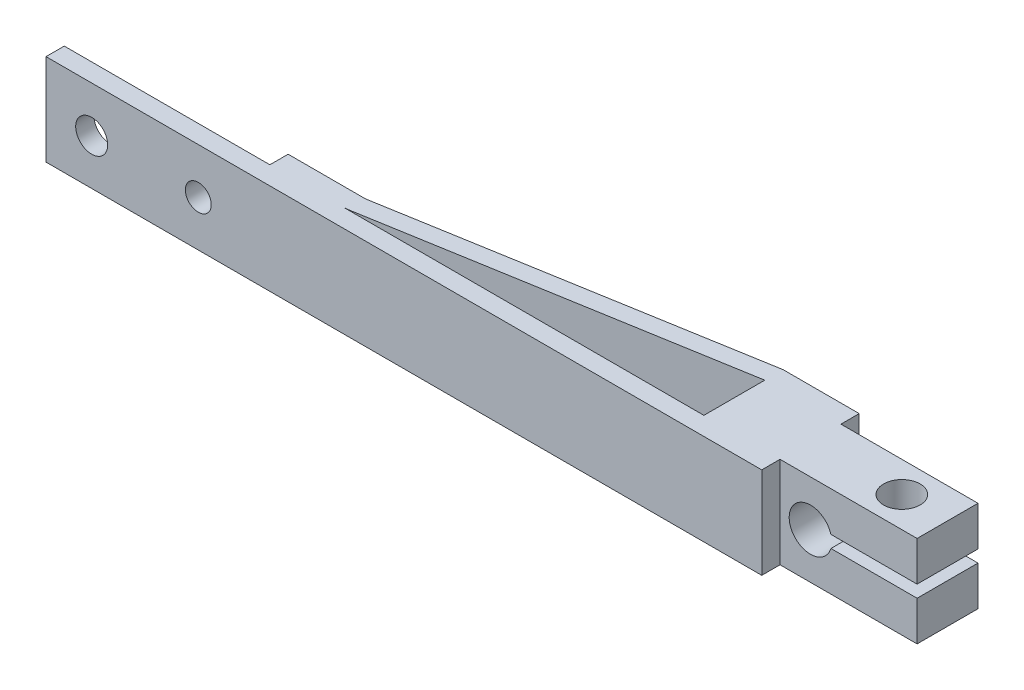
ISO-10303-21;
HEADER;
FILE_DESCRIPTION(('STEP AP214'),'2;1');
FILE_NAME('part.step','',(''),(''),'','','');
FILE_SCHEMA(('AUTOMOTIVE_DESIGN { 1 0 10303 214 1 1 1 1 }'));
ENDSEC;
DATA;
#1=APPLICATION_CONTEXT('core data for automotive mechanical design processes');
#2=APPLICATION_PROTOCOL_DEFINITION('international standard','automotive_design',2000,#1);
#3=PRODUCT_CONTEXT('',#1,'mechanical');
#4=PRODUCT('Part','Part','',(#3));
#5=PRODUCT_RELATED_PRODUCT_CATEGORY('part','',(#4));
#6=PRODUCT_DEFINITION_FORMATION('','',#4);
#7=PRODUCT_DEFINITION_CONTEXT('part definition',#1,'design');
#8=PRODUCT_DEFINITION('design','',#6,#7);
#9=PRODUCT_DEFINITION_SHAPE('','',#8);
#10=(LENGTH_UNIT() NAMED_UNIT(*) SI_UNIT(.MILLI.,.METRE.));
#11=(NAMED_UNIT(*) PLANE_ANGLE_UNIT() SI_UNIT($,.RADIAN.));
#12=(NAMED_UNIT(*) SI_UNIT($,.STERADIAN.) SOLID_ANGLE_UNIT());
#13=UNCERTAINTY_MEASURE_WITH_UNIT(LENGTH_MEASURE(1.E-05),#10,'distance_accuracy_value','');
#14=(GEOMETRIC_REPRESENTATION_CONTEXT(3) GLOBAL_UNCERTAINTY_ASSIGNED_CONTEXT((#13)) GLOBAL_UNIT_ASSIGNED_CONTEXT((#10,
#11,#12)) REPRESENTATION_CONTEXT('',''));
#15=CARTESIAN_POINT('',(0.,0.,0.));
#16=DIRECTION('',(0.,0.,1.));
#17=DIRECTION('',(1.,0.,0.));
#18=AXIS2_PLACEMENT_3D('',#15,#16,#17);
#19=CARTESIAN_POINT('',(25.,0.,20.));
#20=DIRECTION('',(0.,0.,-1.));
#21=DIRECTION('',(-1.,0.,0.));
#22=AXIS2_PLACEMENT_3D('',#19,#20,#21);
#23=PLANE('',#22);
#24=DIRECTION('',(1.,0.,0.));
#25=VECTOR('',#24,1.);
#26=CARTESIAN_POINT('',(25.,0.,20.));
#27=LINE('',#26,#25);
#28=CARTESIAN_POINT('',(-118.851979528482,0.,20.));
#29=VERTEX_POINT('',#28);
#30=CARTESIAN_POINT('',(0.,0.,20.));
#31=VERTEX_POINT('',#30);
#32=EDGE_CURVE('E36',#29,#31,#27,.T.);
#33=ORIENTED_EDGE('',*,*,#32,.F.);
#34=DIRECTION('',(0.,1.,0.));
#35=VECTOR('',#34,1.);
#36=CARTESIAN_POINT('',(-118.851979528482,0.,20.));
#37=LINE('',#36,#35);
#38=CARTESIAN_POINT('',(-118.851979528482,30.,20.));
#39=VERTEX_POINT('',#38);
#40=EDGE_CURVE('E407',#29,#39,#37,.T.);
#41=ORIENTED_EDGE('',*,*,#40,.T.);
#42=DIRECTION('',(-1.,0.,0.));
#43=VECTOR('',#42,1.);
#44=CARTESIAN_POINT('',(25.,30.,20.));
#45=LINE('',#44,#43);
#46=CARTESIAN_POINT('',(0.,30.,20.));
#47=VERTEX_POINT('',#46);
#48=EDGE_CURVE('E233',#47,#39,#45,.T.);
#49=ORIENTED_EDGE('',*,*,#48,.F.);
#50=DIRECTION('',(0.,-1.,0.));
#51=VECTOR('',#50,1.);
#52=CARTESIAN_POINT('',(0.,0.,20.));
#53=LINE('',#52,#51);
#54=EDGE_CURVE('E206',#47,#31,#53,.T.);
#55=ORIENTED_EDGE('',*,*,#54,.T.);
#56=EDGE_LOOP('',(#33,#41,#49,#55));
#57=FACE_BOUND('',#56,.T.);
#58=ADVANCED_FACE('F32',(#57),#23,.T.);
#59=CARTESIAN_POINT('',(0.,0.,20.));
#60=DIRECTION('',(1.,0.,0.));
#61=DIRECTION('',(0.,0.,-1.));
#62=AXIS2_PLACEMENT_3D('',#59,#60,#61);
#63=PLANE('',#62);
#64=DIRECTION('',(0.,-1.,0.));
#65=VECTOR('',#64,1.);
#66=CARTESIAN_POINT('',(0.,0.,0.));
#67=LINE('',#66,#65);
#68=CARTESIAN_POINT('',(0.,30.,0.));
#69=VERTEX_POINT('',#68);
#70=CARTESIAN_POINT('',(0.,0.,0.));
#71=VERTEX_POINT('',#70);
#72=EDGE_CURVE('E260',#69,#71,#67,.T.);
#73=ORIENTED_EDGE('',*,*,#72,.T.);
#74=DIRECTION('',(0.,0.,-1.));
#75=VECTOR('',#74,1.);
#76=CARTESIAN_POINT('',(0.,0.,20.));
#77=LINE('',#76,#75);
#78=EDGE_CURVE('E11',#31,#71,#77,.T.);
#79=ORIENTED_EDGE('',*,*,#78,.F.);
#80=ORIENTED_EDGE('',*,*,#54,.F.);
#81=DIRECTION('',(0.,0.,-1.));
#82=VECTOR('',#81,1.);
#83=CARTESIAN_POINT('',(0.,30.,20.));
#84=LINE('',#83,#82);
#85=EDGE_CURVE('E226',#47,#69,#84,.T.);
#86=ORIENTED_EDGE('',*,*,#85,.T.);
#87=EDGE_LOOP('',(#73,#79,#80,#86));
#88=FACE_BOUND('',#87,.T.);
#89=ADVANCED_FACE('F34',(#88),#63,.F.);
#90=CARTESIAN_POINT('',(0.,0.,20.));
#91=DIRECTION('',(0.,1.,0.));
#92=DIRECTION('',(0.,0.,1.));
#93=AXIS2_PLACEMENT_3D('',#90,#91,#92);
#94=PLANE('',#93);
#95=DIRECTION('',(0.,0.,-1.));
#96=VECTOR('',#95,1.);
#97=CARTESIAN_POINT('',(25.,0.,0.));
#98=LINE('',#97,#96);
#99=CARTESIAN_POINT('',(25.,0.,0.));
#100=VERTEX_POINT('',#99);
#101=CARTESIAN_POINT('',(25.,0.,-6.));
#102=VERTEX_POINT('',#101);
#103=EDGE_CURVE('E378',#100,#102,#98,.T.);
#104=ORIENTED_EDGE('',*,*,#103,.F.);
#105=DIRECTION('',(1.,0.,0.));
#106=VECTOR('',#105,1.);
#107=CARTESIAN_POINT('',(0.,0.,0.));
#108=LINE('',#107,#106);
#109=CARTESIAN_POINT('',(70.,0.,0.));
#110=VERTEX_POINT('',#109);
#111=EDGE_CURVE('E197',#100,#110,#108,.T.);
#112=ORIENTED_EDGE('',*,*,#111,.T.);
#113=DIRECTION('',(0.,0.,-1.));
#114=VECTOR('',#113,1.);
#115=CARTESIAN_POINT('',(70.,0.,20.));
#116=LINE('',#115,#114);
#117=CARTESIAN_POINT('',(70.,0.,20.));
#118=VERTEX_POINT('',#117);
#119=EDGE_CURVE('E42',#118,#110,#116,.T.);
#120=ORIENTED_EDGE('',*,*,#119,.F.);
#121=DIRECTION('',(1.,0.,0.));
#122=VECTOR('',#121,1.);
#123=CARTESIAN_POINT('',(0.,0.,20.));
#124=LINE('',#123,#122);
#125=CARTESIAN_POINT('',(25.,0.,20.));
#126=VERTEX_POINT('',#125);
#127=EDGE_CURVE('E210',#126,#118,#124,.T.);
#128=ORIENTED_EDGE('',*,*,#127,.F.);
#129=DIRECTION('',(0.,0.,-1.));
#130=VECTOR('',#129,1.);
#131=CARTESIAN_POINT('',(25.,0.,26.));
#132=LINE('',#131,#130);
#133=CARTESIAN_POINT('',(25.,0.,26.));
#134=VERTEX_POINT('',#133);
#135=EDGE_CURVE('E334',#134,#126,#132,.T.);
#136=ORIENTED_EDGE('',*,*,#135,.F.);
#137=DIRECTION('',(1.,0.,0.));
#138=VECTOR('',#137,1.);
#139=CARTESIAN_POINT('',(25.,0.,26.));
#140=LINE('',#139,#138);
#141=CARTESIAN_POINT('',(-210.,0.,26.));
#142=VERTEX_POINT('',#141);
#143=EDGE_CURVE('E341',#142,#134,#140,.T.);
#144=ORIENTED_EDGE('',*,*,#143,.F.);
#145=DIRECTION('',(0.,0.,-1.));
#146=VECTOR('',#145,1.);
#147=CARTESIAN_POINT('',(-210.,0.,26.));
#148=LINE('',#147,#146);
#149=CARTESIAN_POINT('',(-210.,0.,20.));
#150=VERTEX_POINT('',#149);
#151=EDGE_CURVE('E340',#142,#150,#148,.T.);
#152=ORIENTED_EDGE('',*,*,#151,.T.);
#153=CARTESIAN_POINT('',(-142.5,0.,20.));
#154=VERTEX_POINT('',#153);
#155=EDGE_CURVE('E245',#150,#154,#27,.T.);
#156=ORIENTED_EDGE('',*,*,#155,.T.);
#157=DIRECTION('',(0.,0.,1.));
#158=VECTOR('',#157,1.);
#159=CARTESIAN_POINT('',(-142.5,0.,20.));
#160=LINE('',#159,#158);
#161=CARTESIAN_POINT('',(-142.5,0.,14.));
#162=VERTEX_POINT('',#161);
#163=EDGE_CURVE('E398',#162,#154,#160,.T.);
#164=ORIENTED_EDGE('',*,*,#163,.F.);
#165=DIRECTION('',(-1.,0.,0.));
#166=VECTOR('',#165,1.);
#167=CARTESIAN_POINT('',(-117.924764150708,0.,14.));
#168=LINE('',#167,#166);
#169=CARTESIAN_POINT('',(-117.924764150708,0.,14.));
#170=VERTEX_POINT('',#169);
#171=EDGE_CURVE('E395',#170,#162,#168,.T.);
#172=ORIENTED_EDGE('',*,*,#171,.F.);
#173=CARTESIAN_POINT('',(-117.924764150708,0.,4.));
#174=DIRECTION('',(0.,-1.,0.));
#175=DIRECTION('',(-1.,0.,0.));
#176=AXIS2_PLACEMENT_3D('',#173,#174,#175);
#177=CIRCLE('',#176,10.);
#178=CARTESIAN_POINT('',(-116.240876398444,0.,13.8572066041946));
#179=VERTEX_POINT('',#178);
#180=EDGE_CURVE('E392',#179,#170,#177,.T.);
#181=ORIENTED_EDGE('',*,*,#180,.F.);
#182=DIRECTION('',(-0.985720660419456,0.,0.168388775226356));
#183=VECTOR('',#182,1.);
#184=CARTESIAN_POINT('',(0.,0.,-6.));
#185=LINE('',#184,#183);
#186=CARTESIAN_POINT('',(0.,0.,-6.));
#187=VERTEX_POINT('',#186);
#188=EDGE_CURVE('E384',#187,#179,#185,.T.);
#189=ORIENTED_EDGE('',*,*,#188,.F.);
#190=DIRECTION('',(-1.,0.,0.));
#191=VECTOR('',#190,1.);
#192=CARTESIAN_POINT('',(0.,0.,-6.));
#193=LINE('',#192,#191);
#194=EDGE_CURVE('E381',#102,#187,#193,.T.);
#195=ORIENTED_EDGE('',*,*,#194,.F.);
#196=EDGE_LOOP('',(#104,#112,#120,#128,#136,#144,#152,#156,#164,#172,#181,#189,#195));
#197=FACE_BOUND('',#196,.T.);
#198=CARTESIAN_POINT('',(55.,0.,10.));
#199=DIRECTION('',(0.,1.,0.));
#200=DIRECTION('',(-1.,0.,0.));
#201=AXIS2_PLACEMENT_3D('',#198,#199,#200);
#202=CIRCLE('',#201,5.99999999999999);
#203=CARTESIAN_POINT('',(49.,0.,10.));
#204=VERTEX_POINT('',#203);
#205=EDGE_CURVE('E250',#204,#204,#202,.T.);
#206=ORIENTED_EDGE('',*,*,#205,.T.);
#207=EDGE_LOOP('',(#206));
#208=FACE_BOUND('',#207,.T.);
#209=ORIENTED_EDGE('',*,*,#78,.T.);
#210=DIRECTION('',(0.985821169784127,0.,-0.167799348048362));
#211=VECTOR('',#210,1.);
#212=CARTESIAN_POINT('',(0.,0.,0.));
#213=LINE('',#212,#211);
#214=CARTESIAN_POINT('',(-116.167189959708,0.,19.773138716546));
#215=VERTEX_POINT('',#214);
#216=EDGE_CURVE('E198',#215,#71,#213,.T.);
#217=ORIENTED_EDGE('',*,*,#216,.F.);
#218=CARTESIAN_POINT('',(-118.851979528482,0.,4.));
#219=DIRECTION('',(0.,1.,0.));
#220=DIRECTION('',(-1.,0.,0.));
#221=AXIS2_PLACEMENT_3D('',#218,#219,#220);
#222=CIRCLE('',#221,16.);
#223=EDGE_CURVE('E400',#29,#215,#222,.T.);
#224=ORIENTED_EDGE('',*,*,#223,.F.);
#225=ORIENTED_EDGE('',*,*,#32,.T.);
#226=EDGE_LOOP('',(#209,#217,#224,#225));
#227=FACE_BOUND('',#226,.T.);
#228=ADVANCED_FACE('F375',(#197,#208,#227),#94,.F.);
#229=CARTESIAN_POINT('',(70.,0.,20.));
#230=DIRECTION('',(-1.,0.,0.));
#231=DIRECTION('',(0.,0.,1.));
#232=AXIS2_PLACEMENT_3D('',#229,#230,#231);
#233=PLANE('',#232);
#234=DIRECTION('',(0.,1.,0.));
#235=VECTOR('',#234,1.);
#236=CARTESIAN_POINT('',(70.,0.,0.));
#237=LINE('',#236,#235);
#238=CARTESIAN_POINT('',(70.,13.,0.));
#239=VERTEX_POINT('',#238);
#240=EDGE_CURVE('E264',#110,#239,#237,.T.);
#241=ORIENTED_EDGE('',*,*,#240,.T.);
#242=DIRECTION('',(0.,0.,-1.));
#243=VECTOR('',#242,1.);
#244=CARTESIAN_POINT('',(70.,13.,20.));
#245=LINE('',#244,#243);
#246=CARTESIAN_POINT('',(70.,13.,20.));
#247=VERTEX_POINT('',#246);
#248=EDGE_CURVE('E292',#247,#239,#245,.T.);
#249=ORIENTED_EDGE('',*,*,#248,.F.);
#250=DIRECTION('',(0.,1.,0.));
#251=VECTOR('',#250,1.);
#252=CARTESIAN_POINT('',(70.,0.,20.));
#253=LINE('',#252,#251);
#254=EDGE_CURVE('E298',#118,#247,#253,.T.);
#255=ORIENTED_EDGE('',*,*,#254,.F.);
#256=ORIENTED_EDGE('',*,*,#119,.T.);
#257=EDGE_LOOP('',(#241,#249,#255,#256));
#258=FACE_BOUND('',#257,.T.);
#259=ADVANCED_FACE('F316',(#258),#233,.F.);
#260=CARTESIAN_POINT('',(70.,13.,20.));
#261=DIRECTION('',(0.,-1.,0.));
#262=DIRECTION('',(1.,0.,0.));
#263=AXIS2_PLACEMENT_3D('',#260,#261,#262);
#264=PLANE('',#263);
#265=CARTESIAN_POINT('',(55.,13.,10.));
#266=DIRECTION('',(0.,-1.,0.));
#267=DIRECTION('',(1.,0.,0.));
#268=AXIS2_PLACEMENT_3D('',#265,#266,#267);
#269=CIRCLE('',#268,5.99999999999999);
#270=CARTESIAN_POINT('',(61.,13.,10.));
#271=VERTEX_POINT('',#270);
#272=EDGE_CURVE('E257',#271,#271,#269,.T.);
#273=ORIENTED_EDGE('',*,*,#272,.T.);
#274=EDGE_LOOP('',(#273));
#275=FACE_BOUND('',#274,.T.);
#276=DIRECTION('',(-1.,0.,0.));
#277=VECTOR('',#276,1.);
#278=CARTESIAN_POINT('',(70.,13.,0.));
#279=LINE('',#278,#277);
#280=CARTESIAN_POINT('',(41.7082039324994,13.,0.));
#281=VERTEX_POINT('',#280);
#282=EDGE_CURVE('E266',#239,#281,#279,.T.);
#283=ORIENTED_EDGE('',*,*,#282,.T.);
#284=DIRECTION('',(0.,0.,-1.));
#285=VECTOR('',#284,1.);
#286=CARTESIAN_POINT('',(41.7082039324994,13.,20.));
#287=LINE('',#286,#285);
#288=CARTESIAN_POINT('',(41.7082039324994,13.,20.));
#289=VERTEX_POINT('',#288);
#290=EDGE_CURVE('E285',#289,#281,#287,.T.);
#291=ORIENTED_EDGE('',*,*,#290,.F.);
#292=DIRECTION('',(-1.,0.,0.));
#293=VECTOR('',#292,1.);
#294=CARTESIAN_POINT('',(70.,13.,20.));
#295=LINE('',#294,#293);
#296=EDGE_CURVE('E308',#247,#289,#295,.T.);
#297=ORIENTED_EDGE('',*,*,#296,.F.);
#298=ORIENTED_EDGE('',*,*,#248,.T.);
#299=EDGE_LOOP('',(#283,#291,#297,#298));
#300=FACE_BOUND('',#299,.T.);
#301=ADVANCED_FACE('F319',(#275,#300),#264,.F.);
#302=CARTESIAN_POINT('',(35.,15.,20.));
#303=DIRECTION('',(0.,0.,-1.));
#304=DIRECTION('',(-1.,0.,0.));
#305=AXIS2_PLACEMENT_3D('',#302,#303,#304);
#306=CYLINDRICAL_SURFACE('',#305,7.);
#307=CARTESIAN_POINT('',(35.,15.,0.));
#308=DIRECTION('',(0.,0.,-1.));
#309=DIRECTION('',(1.,0.,0.));
#310=AXIS2_PLACEMENT_3D('',#307,#308,#309);
#311=CIRCLE('',#310,7.);
#312=CARTESIAN_POINT('',(41.7082039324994,17.,0.));
#313=VERTEX_POINT('',#312);
#314=EDGE_CURVE('E268',#281,#313,#311,.T.);
#315=ORIENTED_EDGE('',*,*,#314,.T.);
#316=DIRECTION('',(0.,0.,-1.));
#317=VECTOR('',#316,1.);
#318=CARTESIAN_POINT('',(41.7082039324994,17.,20.));
#319=LINE('',#318,#317);
#320=CARTESIAN_POINT('',(41.7082039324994,17.,20.));
#321=VERTEX_POINT('',#320);
#322=EDGE_CURVE('E279',#321,#313,#319,.T.);
#323=ORIENTED_EDGE('',*,*,#322,.F.);
#324=CARTESIAN_POINT('',(35.,15.,20.));
#325=DIRECTION('',(0.,0.,-1.));
#326=DIRECTION('',(1.,0.,0.));
#327=AXIS2_PLACEMENT_3D('',#324,#325,#326);
#328=CIRCLE('',#327,7.);
#329=EDGE_CURVE('E306',#289,#321,#328,.T.);
#330=ORIENTED_EDGE('',*,*,#329,.F.);
#331=ORIENTED_EDGE('',*,*,#290,.T.);
#332=EDGE_LOOP('',(#315,#323,#330,#331));
#333=FACE_BOUND('',#332,.T.);
#334=ADVANCED_FACE('F322',(#333),#306,.F.);
#335=CARTESIAN_POINT('',(70.,17.,20.));
#336=DIRECTION('',(0.,1.,0.));
#337=DIRECTION('',(-1.,0.,0.));
#338=AXIS2_PLACEMENT_3D('',#335,#336,#337);
#339=PLANE('',#338);
#340=CARTESIAN_POINT('',(55.,17.,10.));
#341=DIRECTION('',(0.,1.,0.));
#342=DIRECTION('',(-1.,0.,0.));
#343=AXIS2_PLACEMENT_3D('',#340,#341,#342);
#344=CIRCLE('',#343,5.99999999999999);
#345=CARTESIAN_POINT('',(49.,17.,10.));
#346=VERTEX_POINT('',#345);
#347=EDGE_CURVE('E254',#346,#346,#344,.T.);
#348=ORIENTED_EDGE('',*,*,#347,.T.);
#349=EDGE_LOOP('',(#348));
#350=FACE_BOUND('',#349,.T.);
#351=DIRECTION('',(1.,0.,0.));
#352=VECTOR('',#351,1.);
#353=CARTESIAN_POINT('',(70.,17.,0.));
#354=LINE('',#353,#352);
#355=CARTESIAN_POINT('',(70.,17.,0.));
#356=VERTEX_POINT('',#355);
#357=EDGE_CURVE('E212',#313,#356,#354,.T.);
#358=ORIENTED_EDGE('',*,*,#357,.T.);
#359=DIRECTION('',(0.,0.,-1.));
#360=VECTOR('',#359,1.);
#361=CARTESIAN_POINT('',(70.,17.,20.));
#362=LINE('',#361,#360);
#363=CARTESIAN_POINT('',(70.,17.,20.));
#364=VERTEX_POINT('',#363);
#365=EDGE_CURVE('E276',#364,#356,#362,.T.);
#366=ORIENTED_EDGE('',*,*,#365,.F.);
#367=DIRECTION('',(1.,0.,0.));
#368=VECTOR('',#367,1.);
#369=CARTESIAN_POINT('',(70.,17.,20.));
#370=LINE('',#369,#368);
#371=EDGE_CURVE('E304',#321,#364,#370,.T.);
#372=ORIENTED_EDGE('',*,*,#371,.F.);
#373=ORIENTED_EDGE('',*,*,#322,.T.);
#374=EDGE_LOOP('',(#358,#366,#372,#373));
#375=FACE_BOUND('',#374,.T.);
#376=ADVANCED_FACE('F274',(#350,#375),#339,.F.);
#377=CARTESIAN_POINT('',(70.,17.,20.));
#378=DIRECTION('',(-1.,0.,0.));
#379=DIRECTION('',(0.,0.,1.));
#380=AXIS2_PLACEMENT_3D('',#377,#378,#379);
#381=PLANE('',#380);
#382=DIRECTION('',(0.,1.,0.));
#383=VECTOR('',#382,1.);
#384=CARTESIAN_POINT('',(70.,17.,0.));
#385=LINE('',#384,#383);
#386=CARTESIAN_POINT('',(70.,30.,0.));
#387=VERTEX_POINT('',#386);
#388=EDGE_CURVE('E207',#356,#387,#385,.T.);
#389=ORIENTED_EDGE('',*,*,#388,.T.);
#390=DIRECTION('',(0.,0.,-1.));
#391=VECTOR('',#390,1.);
#392=CARTESIAN_POINT('',(70.,30.,20.));
#393=LINE('',#392,#391);
#394=CARTESIAN_POINT('',(70.,30.,20.));
#395=VERTEX_POINT('',#394);
#396=EDGE_CURVE('E205',#395,#387,#393,.T.);
#397=ORIENTED_EDGE('',*,*,#396,.F.);
#398=DIRECTION('',(0.,1.,0.));
#399=VECTOR('',#398,1.);
#400=CARTESIAN_POINT('',(70.,17.,20.));
#401=LINE('',#400,#399);
#402=EDGE_CURVE('E283',#364,#395,#401,.T.);
#403=ORIENTED_EDGE('',*,*,#402,.F.);
#404=ORIENTED_EDGE('',*,*,#365,.T.);
#405=EDGE_LOOP('',(#389,#397,#403,#404));
#406=FACE_BOUND('',#405,.T.);
#407=ADVANCED_FACE('F282',(#406),#381,.F.);
#408=CARTESIAN_POINT('',(0.,30.,20.));
#409=DIRECTION('',(0.,-1.,0.));
#410=DIRECTION('',(1.,0.,0.));
#411=AXIS2_PLACEMENT_3D('',#408,#409,#410);
#412=PLANE('',#411);
#413=DIRECTION('',(-1.,0.,0.));
#414=VECTOR('',#413,1.);
#415=CARTESIAN_POINT('',(0.,30.,0.));
#416=LINE('',#415,#414);
#417=CARTESIAN_POINT('',(25.,30.,0.));
#418=VERTEX_POINT('',#417);
#419=EDGE_CURVE('E195',#387,#418,#416,.T.);
#420=ORIENTED_EDGE('',*,*,#419,.T.);
#421=DIRECTION('',(0.,0.,-1.));
#422=VECTOR('',#421,1.);
#423=CARTESIAN_POINT('',(25.,30.,0.));
#424=LINE('',#423,#422);
#425=CARTESIAN_POINT('',(25.,30.,-6.));
#426=VERTEX_POINT('',#425);
#427=EDGE_CURVE('E178',#418,#426,#424,.T.);
#428=ORIENTED_EDGE('',*,*,#427,.T.);
#429=DIRECTION('',(-1.,0.,0.));
#430=VECTOR('',#429,1.);
#431=CARTESIAN_POINT('',(0.,30.,-6.));
#432=LINE('',#431,#430);
#433=CARTESIAN_POINT('',(0.,30.,-6.));
#434=VERTEX_POINT('',#433);
#435=EDGE_CURVE('E188',#426,#434,#432,.T.);
#436=ORIENTED_EDGE('',*,*,#435,.T.);
#437=DIRECTION('',(-0.985720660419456,0.,0.168388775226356));
#438=VECTOR('',#437,1.);
#439=CARTESIAN_POINT('',(0.,30.,-6.));
#440=LINE('',#439,#438);
#441=CARTESIAN_POINT('',(-116.240876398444,30.,13.8572066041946));
#442=VERTEX_POINT('',#441);
#443=EDGE_CURVE('E668',#434,#442,#440,.T.);
#444=ORIENTED_EDGE('',*,*,#443,.T.);
#445=CARTESIAN_POINT('',(-117.924764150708,30.,4.));
#446=DIRECTION('',(0.,-1.,0.));
#447=DIRECTION('',(-1.,0.,0.));
#448=AXIS2_PLACEMENT_3D('',#445,#446,#447);
#449=CIRCLE('',#448,10.);
#450=CARTESIAN_POINT('',(-117.924764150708,30.,14.));
#451=VERTEX_POINT('',#450);
#452=EDGE_CURVE('E670',#442,#451,#449,.T.);
#453=ORIENTED_EDGE('',*,*,#452,.T.);
#454=DIRECTION('',(-1.,0.,0.));
#455=VECTOR('',#454,1.);
#456=CARTESIAN_POINT('',(-117.924764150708,30.,14.));
#457=LINE('',#456,#455);
#458=CARTESIAN_POINT('',(-142.5,30.,14.));
#459=VERTEX_POINT('',#458);
#460=EDGE_CURVE('E675',#451,#459,#457,.T.);
#461=ORIENTED_EDGE('',*,*,#460,.T.);
#462=DIRECTION('',(0.,0.,1.));
#463=VECTOR('',#462,1.);
#464=CARTESIAN_POINT('',(-142.5,30.,20.));
#465=LINE('',#464,#463);
#466=CARTESIAN_POINT('',(-142.5,30.,20.));
#467=VERTEX_POINT('',#466);
#468=EDGE_CURVE('E50',#459,#467,#465,.T.);
#469=ORIENTED_EDGE('',*,*,#468,.T.);
#470=CARTESIAN_POINT('',(-210.,30.,20.));
#471=VERTEX_POINT('',#470);
#472=EDGE_CURVE('E231',#467,#471,#45,.T.);
#473=ORIENTED_EDGE('',*,*,#472,.T.);
#474=DIRECTION('',(0.,0.,-1.));
#475=VECTOR('',#474,1.);
#476=CARTESIAN_POINT('',(-210.,30.,26.));
#477=LINE('',#476,#475);
#478=CARTESIAN_POINT('',(-210.,30.,26.));
#479=VERTEX_POINT('',#478);
#480=EDGE_CURVE('E330',#479,#471,#477,.T.);
#481=ORIENTED_EDGE('',*,*,#480,.F.);
#482=DIRECTION('',(-1.,0.,0.));
#483=VECTOR('',#482,1.);
#484=CARTESIAN_POINT('',(25.,30.,26.));
#485=LINE('',#484,#483);
#486=CARTESIAN_POINT('',(25.,30.,26.));
#487=VERTEX_POINT('',#486);
#488=EDGE_CURVE('E326',#487,#479,#485,.T.);
#489=ORIENTED_EDGE('',*,*,#488,.F.);
#490=DIRECTION('',(0.,0.,-1.));
#491=VECTOR('',#490,1.);
#492=CARTESIAN_POINT('',(25.,30.,26.));
#493=LINE('',#492,#491);
#494=CARTESIAN_POINT('',(25.,30.,20.));
#495=VERTEX_POINT('',#494);
#496=EDGE_CURVE('E251',#487,#495,#493,.T.);
#497=ORIENTED_EDGE('',*,*,#496,.T.);
#498=DIRECTION('',(-1.,0.,0.));
#499=VECTOR('',#498,1.);
#500=CARTESIAN_POINT('',(0.,30.,20.));
#501=LINE('',#500,#499);
#502=EDGE_CURVE('E229',#395,#495,#501,.T.);
#503=ORIENTED_EDGE('',*,*,#502,.F.);
#504=ORIENTED_EDGE('',*,*,#396,.T.);
#505=EDGE_LOOP('',(#420,#428,#436,#444,#453,#461,#469,#473,#481,#489,#497,#503,#504));
#506=FACE_BOUND('',#505,.T.);
#507=CARTESIAN_POINT('',(55.,30.,10.));
#508=DIRECTION('',(0.,1.,0.));
#509=DIRECTION('',(-1.,0.,0.));
#510=AXIS2_PLACEMENT_3D('',#507,#508,#509);
#511=CIRCLE('',#510,5.99999999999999);
#512=CARTESIAN_POINT('',(49.,30.,10.));
#513=VERTEX_POINT('',#512);
#514=EDGE_CURVE('E247',#513,#513,#511,.T.);
#515=ORIENTED_EDGE('',*,*,#514,.F.);
#516=EDGE_LOOP('',(#515));
#517=FACE_BOUND('',#516,.T.);
#518=DIRECTION('',(0.985821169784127,0.,-0.167799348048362));
#519=VECTOR('',#518,1.);
#520=CARTESIAN_POINT('',(0.,30.,0.));
#521=LINE('',#520,#519);
#522=CARTESIAN_POINT('',(-116.167189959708,30.,19.773138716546));
#523=VERTEX_POINT('',#522);
#524=EDGE_CURVE('E382',#523,#69,#521,.T.);
#525=ORIENTED_EDGE('',*,*,#524,.T.);
#526=ORIENTED_EDGE('',*,*,#85,.F.);
#527=ORIENTED_EDGE('',*,*,#48,.T.);
#528=CARTESIAN_POINT('',(-118.851979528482,30.,4.));
#529=DIRECTION('',(0.,1.,0.));
#530=DIRECTION('',(-1.,0.,0.));
#531=AXIS2_PLACEMENT_3D('',#528,#529,#530);
#532=CIRCLE('',#531,16.);
#533=EDGE_CURVE('E386',#39,#523,#532,.T.);
#534=ORIENTED_EDGE('',*,*,#533,.T.);
#535=EDGE_LOOP('',(#525,#526,#527,#534));
#536=FACE_BOUND('',#535,.T.);
#537=ADVANCED_FACE('F201',(#506,#517,#536),#412,.F.);
#538=CARTESIAN_POINT('',(35.,15.,20.));
#539=DIRECTION('',(0.,0.,1.));
#540=DIRECTION('',(1.,0.,0.));
#541=AXIS2_PLACEMENT_3D('',#538,#539,#540);
#542=PLANE('',#541);
#543=DIRECTION('',(0.,1.,0.));
#544=VECTOR('',#543,1.);
#545=CARTESIAN_POINT('',(25.,30.,20.));
#546=LINE('',#545,#544);
#547=EDGE_CURVE('E58',#126,#495,#546,.T.);
#548=ORIENTED_EDGE('',*,*,#547,.F.);
#549=ORIENTED_EDGE('',*,*,#127,.T.);
#550=ORIENTED_EDGE('',*,*,#254,.T.);
#551=ORIENTED_EDGE('',*,*,#296,.T.);
#552=ORIENTED_EDGE('',*,*,#329,.T.);
#553=ORIENTED_EDGE('',*,*,#371,.T.);
#554=ORIENTED_EDGE('',*,*,#402,.T.);
#555=ORIENTED_EDGE('',*,*,#502,.T.);
#556=EDGE_LOOP('',(#548,#549,#550,#551,#552,#553,#554,#555));
#557=FACE_BOUND('',#556,.T.);
#558=ADVANCED_FACE('F311',(#557),#542,.T.);
#559=CARTESIAN_POINT('',(35.,15.,0.));
#560=DIRECTION('',(0.,0.,1.));
#561=DIRECTION('',(1.,0.,0.));
#562=AXIS2_PLACEMENT_3D('',#559,#560,#561);
#563=PLANE('',#562);
#564=ORIENTED_EDGE('',*,*,#111,.F.);
#565=DIRECTION('',(0.,1.,0.));
#566=VECTOR('',#565,1.);
#567=CARTESIAN_POINT('',(25.,0.,0.));
#568=LINE('',#567,#566);
#569=EDGE_CURVE('E182',#100,#418,#568,.T.);
#570=ORIENTED_EDGE('',*,*,#569,.T.);
#571=ORIENTED_EDGE('',*,*,#419,.F.);
#572=ORIENTED_EDGE('',*,*,#388,.F.);
#573=ORIENTED_EDGE('',*,*,#357,.F.);
#574=ORIENTED_EDGE('',*,*,#314,.F.);
#575=ORIENTED_EDGE('',*,*,#282,.F.);
#576=ORIENTED_EDGE('',*,*,#240,.F.);
#577=EDGE_LOOP('',(#564,#570,#571,#572,#573,#574,#575,#576));
#578=FACE_BOUND('',#577,.T.);
#579=ADVANCED_FACE('F193',(#578),#563,.F.);
#580=CARTESIAN_POINT('',(55.,0.,10.));
#581=DIRECTION('',(0.,1.,0.));
#582=DIRECTION('',(-1.,0.,0.));
#583=AXIS2_PLACEMENT_3D('',#580,#581,#582);
#584=CYLINDRICAL_SURFACE('',#583,5.99999999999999);
#585=ORIENTED_EDGE('',*,*,#514,.T.);
#586=EDGE_LOOP('',(#585));
#587=FACE_BOUND('',#586,.T.);
#588=ORIENTED_EDGE('',*,*,#347,.F.);
#589=EDGE_LOOP('',(#588));
#590=FACE_BOUND('',#589,.T.);
#591=ADVANCED_FACE('F462',(#587,#590),#584,.F.);
#592=ORIENTED_EDGE('',*,*,#205,.F.);
#593=EDGE_LOOP('',(#592));
#594=FACE_BOUND('',#593,.T.);
#595=ORIENTED_EDGE('',*,*,#272,.F.);
#596=EDGE_LOOP('',(#595));
#597=FACE_BOUND('',#596,.T.);
#598=ADVANCED_FACE('F457',(#594,#597),#584,.F.);
#599=CARTESIAN_POINT('',(25.,0.,26.));
#600=DIRECTION('',(0.,0.,-1.));
#601=DIRECTION('',(-1.,0.,0.));
#602=AXIS2_PLACEMENT_3D('',#599,#600,#601);
#603=PLANE('',#602);
#604=CARTESIAN_POINT('',(-195.,15.,26.));
#605=DIRECTION('',(0.,0.,1.));
#606=DIRECTION('',(1.,0.,0.));
#607=AXIS2_PLACEMENT_3D('',#604,#605,#606);
#608=CIRCLE('',#607,5.25);
#609=CARTESIAN_POINT('',(-189.75,15.,26.));
#610=VERTEX_POINT('',#609);
#611=EDGE_CURVE('E335',#610,#610,#608,.T.);
#612=ORIENTED_EDGE('',*,*,#611,.F.);
#613=EDGE_LOOP('',(#612));
#614=FACE_BOUND('',#613,.T.);
#615=DIRECTION('',(0.,1.,0.));
#616=VECTOR('',#615,1.);
#617=CARTESIAN_POINT('',(25.,30.,26.));
#618=LINE('',#617,#616);
#619=EDGE_CURVE('E367',#134,#487,#618,.T.);
#620=ORIENTED_EDGE('',*,*,#619,.T.);
#621=ORIENTED_EDGE('',*,*,#488,.T.);
#622=DIRECTION('',(0.,-1.,0.));
#623=VECTOR('',#622,1.);
#624=CARTESIAN_POINT('',(-210.,30.,26.));
#625=LINE('',#624,#623);
#626=EDGE_CURVE('E344',#479,#142,#625,.T.);
#627=ORIENTED_EDGE('',*,*,#626,.T.);
#628=ORIENTED_EDGE('',*,*,#143,.T.);
#629=EDGE_LOOP('',(#620,#621,#627,#628));
#630=FACE_BOUND('',#629,.T.);
#631=CARTESIAN_POINT('',(-160.,15.,26.));
#632=DIRECTION('',(0.,0.,1.));
#633=DIRECTION('',(1.,0.,0.));
#634=AXIS2_PLACEMENT_3D('',#631,#632,#633);
#635=CIRCLE('',#634,4.24999999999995);
#636=CARTESIAN_POINT('',(-155.75,15.,26.));
#637=VERTEX_POINT('',#636);
#638=EDGE_CURVE('E423',#637,#637,#635,.T.);
#639=ORIENTED_EDGE('',*,*,#638,.F.);
#640=EDGE_LOOP('',(#639));
#641=FACE_BOUND('',#640,.T.);
#642=ADVANCED_FACE('F373',(#614,#630,#641),#603,.F.);
#643=DIRECTION('',(0.,1.,0.));
#644=VECTOR('',#643,1.);
#645=CARTESIAN_POINT('',(-142.5,0.,20.));
#646=LINE('',#645,#644);
#647=EDGE_CURVE('E410',#154,#467,#646,.T.);
#648=ORIENTED_EDGE('',*,*,#647,.F.);
#649=ORIENTED_EDGE('',*,*,#155,.F.);
#650=DIRECTION('',(0.,-1.,0.));
#651=VECTOR('',#650,1.);
#652=CARTESIAN_POINT('',(-210.,30.,20.));
#653=LINE('',#652,#651);
#654=EDGE_CURVE('E239',#471,#150,#653,.T.);
#655=ORIENTED_EDGE('',*,*,#654,.F.);
#656=ORIENTED_EDGE('',*,*,#472,.F.);
#657=EDGE_LOOP('',(#648,#649,#655,#656));
#658=FACE_BOUND('',#657,.T.);
#659=CARTESIAN_POINT('',(-195.,15.,20.));
#660=DIRECTION('',(0.,0.,1.));
#661=DIRECTION('',(1.,0.,0.));
#662=AXIS2_PLACEMENT_3D('',#659,#660,#661);
#663=CIRCLE('',#662,5.25);
#664=CARTESIAN_POINT('',(-189.75,15.,20.));
#665=VERTEX_POINT('',#664);
#666=EDGE_CURVE('E338',#665,#665,#663,.T.);
#667=ORIENTED_EDGE('',*,*,#666,.T.);
#668=EDGE_LOOP('',(#667));
#669=FACE_BOUND('',#668,.T.);
#670=CARTESIAN_POINT('',(-160.,15.,20.));
#671=DIRECTION('',(0.,0.,1.));
#672=DIRECTION('',(1.,0.,0.));
#673=AXIS2_PLACEMENT_3D('',#670,#671,#672);
#674=CIRCLE('',#673,4.24999999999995);
#675=CARTESIAN_POINT('',(-155.75,15.,20.));
#676=VERTEX_POINT('',#675);
#677=EDGE_CURVE('E406',#676,#676,#674,.T.);
#678=ORIENTED_EDGE('',*,*,#677,.T.);
#679=EDGE_LOOP('',(#678));
#680=FACE_BOUND('',#679,.T.);
#681=ADVANCED_FACE('F360',(#658,#669,#680),#23,.T.);
#682=CARTESIAN_POINT('',(25.,30.,26.));
#683=DIRECTION('',(-1.,0.,0.));
#684=DIRECTION('',(0.,-1.,0.));
#685=AXIS2_PLACEMENT_3D('',#682,#683,#684);
#686=PLANE('',#685);
#687=ORIENTED_EDGE('',*,*,#547,.T.);
#688=ORIENTED_EDGE('',*,*,#496,.F.);
#689=ORIENTED_EDGE('',*,*,#619,.F.);
#690=ORIENTED_EDGE('',*,*,#135,.T.);
#691=EDGE_LOOP('',(#687,#688,#689,#690));
#692=FACE_BOUND('',#691,.T.);
#693=ADVANCED_FACE('F332',(#692),#686,.F.);
#694=CARTESIAN_POINT('',(-210.,30.,26.));
#695=DIRECTION('',(1.,0.,0.));
#696=DIRECTION('',(0.,0.,-1.));
#697=AXIS2_PLACEMENT_3D('',#694,#695,#696);
#698=PLANE('',#697);
#699=ORIENTED_EDGE('',*,*,#654,.T.);
#700=ORIENTED_EDGE('',*,*,#151,.F.);
#701=ORIENTED_EDGE('',*,*,#626,.F.);
#702=ORIENTED_EDGE('',*,*,#480,.T.);
#703=EDGE_LOOP('',(#699,#700,#701,#702));
#704=FACE_BOUND('',#703,.T.);
#705=ADVANCED_FACE('F354',(#704),#698,.F.);
#706=CARTESIAN_POINT('',(-195.,15.,26.));
#707=DIRECTION('',(0.,0.,-1.));
#708=DIRECTION('',(-1.,0.,0.));
#709=AXIS2_PLACEMENT_3D('',#706,#707,#708);
#710=CYLINDRICAL_SURFACE('',#709,5.25);
#711=ORIENTED_EDGE('',*,*,#611,.T.);
#712=EDGE_LOOP('',(#711));
#713=FACE_BOUND('',#712,.T.);
#714=ORIENTED_EDGE('',*,*,#666,.F.);
#715=EDGE_LOOP('',(#714));
#716=FACE_BOUND('',#715,.T.);
#717=ADVANCED_FACE('F430',(#713,#716),#710,.F.);
#718=CARTESIAN_POINT('',(-160.,15.,26.));
#719=DIRECTION('',(0.,0.,-1.));
#720=DIRECTION('',(-1.,0.,0.));
#721=AXIS2_PLACEMENT_3D('',#718,#719,#720);
#722=CYLINDRICAL_SURFACE('',#721,4.24999999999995);
#723=ORIENTED_EDGE('',*,*,#638,.T.);
#724=EDGE_LOOP('',(#723));
#725=FACE_BOUND('',#724,.T.);
#726=ORIENTED_EDGE('',*,*,#677,.F.);
#727=EDGE_LOOP('',(#726));
#728=FACE_BOUND('',#727,.T.);
#729=ADVANCED_FACE('F432',(#725,#728),#722,.F.);
#730=CARTESIAN_POINT('',(0.,0.,0.));
#731=DIRECTION('',(0.167799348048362,0.,0.985821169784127));
#732=DIRECTION('',(0.985821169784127,0.,-0.167799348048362));
#733=AXIS2_PLACEMENT_3D('',#730,#731,#732);
#734=PLANE('',#733);
#735=ORIENTED_EDGE('',*,*,#524,.F.);
#736=DIRECTION('',(0.,1.,0.));
#737=VECTOR('',#736,1.);
#738=CARTESIAN_POINT('',(-116.167189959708,0.,19.773138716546));
#739=LINE('',#738,#737);
#740=EDGE_CURVE('E404',#215,#523,#739,.T.);
#741=ORIENTED_EDGE('',*,*,#740,.F.);
#742=ORIENTED_EDGE('',*,*,#216,.T.);
#743=ORIENTED_EDGE('',*,*,#72,.F.);
#744=EDGE_LOOP('',(#735,#741,#742,#743));
#745=FACE_BOUND('',#744,.T.);
#746=ADVANCED_FACE('F439',(#745),#734,.T.);
#747=CARTESIAN_POINT('',(-118.851979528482,0.,4.));
#748=DIRECTION('',(0.,1.,0.));
#749=DIRECTION('',(-1.,0.,0.));
#750=AXIS2_PLACEMENT_3D('',#747,#748,#749);
#751=CYLINDRICAL_SURFACE('',#750,16.);
#752=ORIENTED_EDGE('',*,*,#533,.F.);
#753=ORIENTED_EDGE('',*,*,#40,.F.);
#754=ORIENTED_EDGE('',*,*,#223,.T.);
#755=ORIENTED_EDGE('',*,*,#740,.T.);
#756=EDGE_LOOP('',(#752,#753,#754,#755));
#757=FACE_BOUND('',#756,.T.);
#758=ADVANCED_FACE('F594',(#757),#751,.T.);
#759=CARTESIAN_POINT('',(-142.5,0.,20.));
#760=DIRECTION('',(-1.,0.,0.));
#761=DIRECTION('',(0.,-1.,0.));
#762=AXIS2_PLACEMENT_3D('',#759,#760,#761);
#763=PLANE('',#762);
#764=ORIENTED_EDGE('',*,*,#468,.F.);
#765=DIRECTION('',(0.,1.,0.));
#766=VECTOR('',#765,1.);
#767=CARTESIAN_POINT('',(-142.5,0.,14.));
#768=LINE('',#767,#766);
#769=EDGE_CURVE('E412',#162,#459,#768,.T.);
#770=ORIENTED_EDGE('',*,*,#769,.F.);
#771=ORIENTED_EDGE('',*,*,#163,.T.);
#772=ORIENTED_EDGE('',*,*,#647,.T.);
#773=EDGE_LOOP('',(#764,#770,#771,#772));
#774=FACE_BOUND('',#773,.T.);
#775=ADVANCED_FACE('F601',(#774),#763,.T.);
#776=CARTESIAN_POINT('',(-117.924764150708,0.,14.));
#777=DIRECTION('',(0.,0.,-1.));
#778=DIRECTION('',(-1.,0.,0.));
#779=AXIS2_PLACEMENT_3D('',#776,#777,#778);
#780=PLANE('',#779);
#781=ORIENTED_EDGE('',*,*,#460,.F.);
#782=DIRECTION('',(0.,1.,0.));
#783=VECTOR('',#782,1.);
#784=CARTESIAN_POINT('',(-117.924764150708,0.,14.));
#785=LINE('',#784,#783);
#786=EDGE_CURVE('E414',#170,#451,#785,.T.);
#787=ORIENTED_EDGE('',*,*,#786,.F.);
#788=ORIENTED_EDGE('',*,*,#171,.T.);
#789=ORIENTED_EDGE('',*,*,#769,.T.);
#790=EDGE_LOOP('',(#781,#787,#788,#789));
#791=FACE_BOUND('',#790,.T.);
#792=ADVANCED_FACE('F609',(#791),#780,.T.);
#793=CARTESIAN_POINT('',(-117.924764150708,0.,4.));
#794=DIRECTION('',(0.,1.,0.));
#795=DIRECTION('',(-1.,0.,0.));
#796=AXIS2_PLACEMENT_3D('',#793,#794,#795);
#797=CYLINDRICAL_SURFACE('',#796,10.);
#798=ORIENTED_EDGE('',*,*,#452,.F.);
#799=DIRECTION('',(0.,1.,0.));
#800=VECTOR('',#799,1.);
#801=CARTESIAN_POINT('',(-116.240876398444,0.,13.8572066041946));
#802=LINE('',#801,#800);
#803=EDGE_CURVE('E416',#179,#442,#802,.T.);
#804=ORIENTED_EDGE('',*,*,#803,.F.);
#805=ORIENTED_EDGE('',*,*,#180,.T.);
#806=ORIENTED_EDGE('',*,*,#786,.T.);
#807=EDGE_LOOP('',(#798,#804,#805,#806));
#808=FACE_BOUND('',#807,.T.);
#809=ADVANCED_FACE('F617',(#808),#797,.F.);
#810=CARTESIAN_POINT('',(0.,0.,-6.));
#811=DIRECTION('',(-0.168388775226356,0.,-0.985720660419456));
#812=DIRECTION('',(-0.985720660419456,0.,0.168388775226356));
#813=AXIS2_PLACEMENT_3D('',#810,#811,#812);
#814=PLANE('',#813);
#815=ORIENTED_EDGE('',*,*,#443,.F.);
#816=DIRECTION('',(0.,1.,0.));
#817=VECTOR('',#816,1.);
#818=CARTESIAN_POINT('',(0.,0.,-6.));
#819=LINE('',#818,#817);
#820=EDGE_CURVE('E418',#187,#434,#819,.T.);
#821=ORIENTED_EDGE('',*,*,#820,.F.);
#822=ORIENTED_EDGE('',*,*,#188,.T.);
#823=ORIENTED_EDGE('',*,*,#803,.T.);
#824=EDGE_LOOP('',(#815,#821,#822,#823));
#825=FACE_BOUND('',#824,.T.);
#826=ADVANCED_FACE('F625',(#825),#814,.T.);
#827=CARTESIAN_POINT('',(0.,0.,-6.));
#828=DIRECTION('',(0.,0.,-1.));
#829=DIRECTION('',(-1.,0.,0.));
#830=AXIS2_PLACEMENT_3D('',#827,#828,#829);
#831=PLANE('',#830);
#832=ORIENTED_EDGE('',*,*,#435,.F.);
#833=DIRECTION('',(0.,1.,0.));
#834=VECTOR('',#833,1.);
#835=CARTESIAN_POINT('',(25.,0.,-6.));
#836=LINE('',#835,#834);
#837=EDGE_CURVE('E184',#102,#426,#836,.T.);
#838=ORIENTED_EDGE('',*,*,#837,.F.);
#839=ORIENTED_EDGE('',*,*,#194,.T.);
#840=ORIENTED_EDGE('',*,*,#820,.T.);
#841=EDGE_LOOP('',(#832,#838,#839,#840));
#842=FACE_BOUND('',#841,.T.);
#843=ADVANCED_FACE('F633',(#842),#831,.T.);
#844=CARTESIAN_POINT('',(25.,0.,0.));
#845=DIRECTION('',(1.,0.,0.));
#846=DIRECTION('',(0.,1.,0.));
#847=AXIS2_PLACEMENT_3D('',#844,#845,#846);
#848=PLANE('',#847);
#849=ORIENTED_EDGE('',*,*,#427,.F.);
#850=ORIENTED_EDGE('',*,*,#569,.F.);
#851=ORIENTED_EDGE('',*,*,#103,.T.);
#852=ORIENTED_EDGE('',*,*,#837,.T.);
#853=EDGE_LOOP('',(#849,#850,#851,#852));
#854=FACE_BOUND('',#853,.T.);
#855=ADVANCED_FACE('F180',(#854),#848,.T.);
#856=CLOSED_SHELL('',(#58,#89,#228,#259,#301,#334,#376,#407,#537,#558,#579,#591,#598,#642,#681,
#693,#705,#717,#729,#746,#758,#775,#792,#809,#826,#843,#855));
#857=MANIFOLD_SOLID_BREP('B2',#856);
#858=ADVANCED_BREP_SHAPE_REPRESENTATION('',(#18,#857),#14);
#859=SHAPE_DEFINITION_REPRESENTATION(#9,#858);
ENDSEC;
END-ISO-10303-21;
